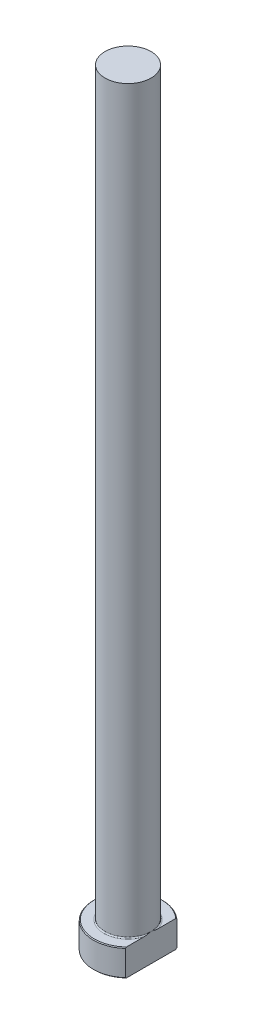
from build123d import *
from build123d.topology import SkipClean

# Parameters (mm, degrees)
CHAMFER1_SIZE = 0.2
FILLET1_R     = 0.3
KEY_DEPTH     = 201.404590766


with BuildPart() as part:
    # Sketch1 → Revolve1 (revolve)
    with BuildSketch(Plane.XY, mode=Mode.PRIVATE) as revolve1_sk:
        Polygon((0, 0), (-9, 0), (-9, 7), (-6, 7), (-6, 200), (0, 200), align=None)
    revolve(revolve1_sk.sketch.rotate(Axis((0, 259.958771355, 0), (0, -1, 0)), 270), axis=Axis((0, 259.958771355, 0), (0, -1, 0)))

    # Chamfer1
    chamfer1_edges = [part.edges().sort_by_distance(p)[0] for p in [
        (0, 7, -9),
        (0, 0, -9),
    ]]
    chamfer(chamfer1_edges, length=CHAMFER1_SIZE)

    # Fillet1
    fillet1_edges = [part.edges().sort_by_distance(p)[0] for p in [
        (0, 7, -6),
    ]]
    fillet(fillet1_edges, radius=FILLET1_R)

    # Sketch2 → KEY (cut, through all)
    with SkipClean():  # the faces are left unmerged after this step: merging them gives an invalid solid
        with BuildSketch(Plane(origin=(0, 0, 0), x_dir=(1, 0, 0), z_dir=(0, 1, 0))):
            with BuildLine():
                Line((6, 6.708203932), (6, -6.708203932))
                ThreePointArc((6, -6.708203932), (9, 0), (6, 6.708203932))
            make_face()
        extrude(amount=KEY_DEPTH, mode=Mode.SUBTRACT)


solid = part.part
